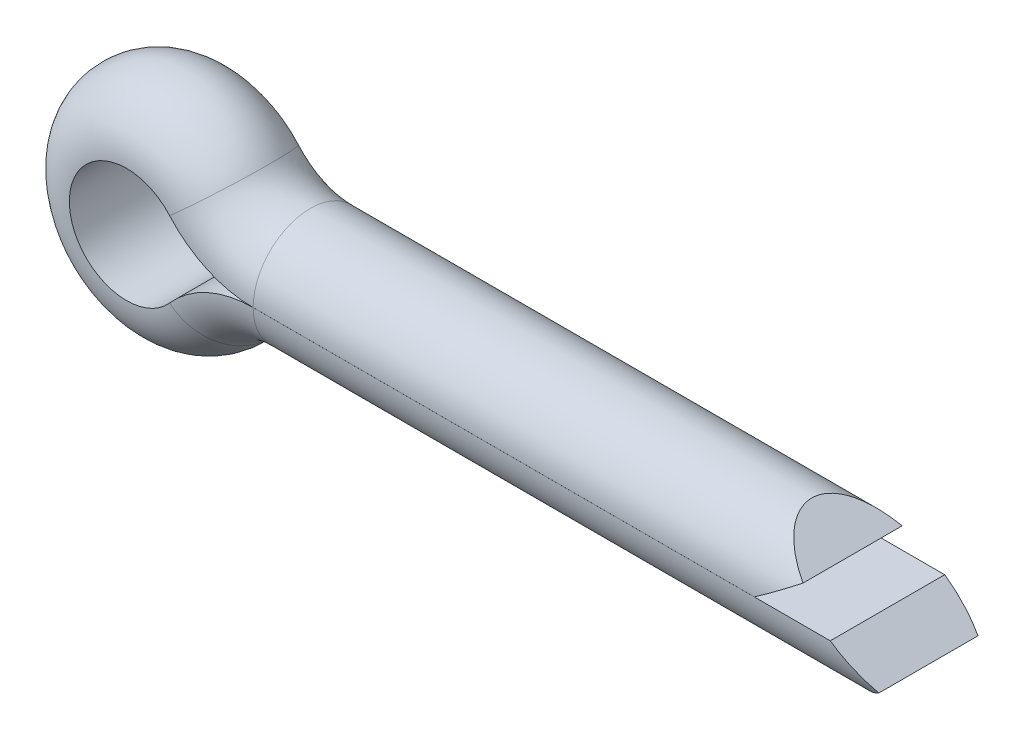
ISO-10303-21;
HEADER;
FILE_DESCRIPTION(('STEP AP214'),'2;1');
FILE_NAME('part.step','',(''),(''),'','','');
FILE_SCHEMA(('AUTOMOTIVE_DESIGN { 1 0 10303 214 1 1 1 1 }'));
ENDSEC;
DATA;
#1=APPLICATION_CONTEXT('core data for automotive mechanical design processes');
#2=APPLICATION_PROTOCOL_DEFINITION('international standard','automotive_design',2000,#1);
#3=PRODUCT_CONTEXT('',#1,'mechanical');
#4=PRODUCT('Part','Part','',(#3));
#5=PRODUCT_RELATED_PRODUCT_CATEGORY('part','',(#4));
#6=PRODUCT_DEFINITION_FORMATION('','',#4);
#7=PRODUCT_DEFINITION_CONTEXT('part definition',#1,'design');
#8=PRODUCT_DEFINITION('design','',#6,#7);
#9=PRODUCT_DEFINITION_SHAPE('','',#8);
#10=(LENGTH_UNIT() NAMED_UNIT(*) SI_UNIT(.MILLI.,.METRE.));
#11=(NAMED_UNIT(*) PLANE_ANGLE_UNIT() SI_UNIT($,.RADIAN.));
#12=(NAMED_UNIT(*) SI_UNIT($,.STERADIAN.) SOLID_ANGLE_UNIT());
#13=UNCERTAINTY_MEASURE_WITH_UNIT(LENGTH_MEASURE(1.E-05),#10,'distance_accuracy_value','');
#14=(GEOMETRIC_REPRESENTATION_CONTEXT(3) GLOBAL_UNCERTAINTY_ASSIGNED_CONTEXT((#13)) GLOBAL_UNIT_ASSIGNED_CONTEXT((#10,
#11,#12)) REPRESENTATION_CONTEXT('',''));
#15=CARTESIAN_POINT('',(0.,0.,0.));
#16=DIRECTION('',(0.,0.,1.));
#17=DIRECTION('',(1.,0.,0.));
#18=AXIS2_PLACEMENT_3D('',#15,#16,#17);
#19=CARTESIAN_POINT('',(0.,-0.00199999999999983,4.74999957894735));
#20=DIRECTION('',(0.,-1.,0.));
#21=DIRECTION('',(0.,0.,-1.));
#22=AXIS2_PLACEMENT_3D('',#19,#20,#21);
#23=PLANE('',#22);
#24=DIRECTION('',(1.,0.,0.));
#25=VECTOR('',#24,1.);
#26=CARTESIAN_POINT('',(0.,-0.00199999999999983,4.74999957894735));
#27=LINE('',#26,#25);
#28=CARTESIAN_POINT('',(0.,-0.00199999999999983,4.74999957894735));
#29=VERTEX_POINT('',#28);
#30=CARTESIAN_POINT('',(47.9010703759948,-0.00199999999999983,4.74999957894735));
#31=VERTEX_POINT('',#30);
#32=EDGE_CURVE('E40',#29,#31,#27,.T.);
#33=ORIENTED_EDGE('',*,*,#32,.T.);
#34=DIRECTION('',(0.,0.,-1.));
#35=VECTOR('',#34,1.);
#36=CARTESIAN_POINT('',(47.9010703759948,-0.00199999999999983,4.74999957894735));
#37=LINE('',#36,#35);
#38=CARTESIAN_POINT('',(47.9010703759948,-0.00199999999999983,-4.74999957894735));
#39=VERTEX_POINT('',#38);
#40=EDGE_CURVE('E96',#31,#39,#37,.T.);
#41=ORIENTED_EDGE('',*,*,#40,.T.);
#42=DIRECTION('',(1.,0.,0.));
#43=VECTOR('',#42,1.);
#44=CARTESIAN_POINT('',(0.,-0.00199999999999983,-4.74999957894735));
#45=LINE('',#44,#43);
#46=CARTESIAN_POINT('',(0.,-0.00199999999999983,-4.74999957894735));
#47=VERTEX_POINT('',#46);
#48=EDGE_CURVE('E11',#47,#39,#45,.T.);
#49=ORIENTED_EDGE('',*,*,#48,.F.);
#50=DIRECTION('',(0.,0.,-1.));
#51=VECTOR('',#50,1.);
#52=CARTESIAN_POINT('',(0.,-0.00199999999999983,4.74999957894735));
#53=LINE('',#52,#51);
#54=EDGE_CURVE('E113',#29,#47,#53,.T.);
#55=ORIENTED_EDGE('',*,*,#54,.F.);
#56=EDGE_LOOP('',(#33,#41,#49,#55));
#57=FACE_BOUND('',#56,.T.);
#58=ADVANCED_FACE('F33',(#57),#23,.F.);
#59=CARTESIAN_POINT('',(0.,0.,0.));
#60=DIRECTION('',(1.,0.,0.));
#61=DIRECTION('',(0.,0.,-1.));
#62=AXIS2_PLACEMENT_3D('',#59,#60,#61);
#63=CYLINDRICAL_SURFACE('',#62,4.75);
#64=CARTESIAN_POINT('',(54.6847948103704,0.,0.));
#65=DIRECTION('',(-0.574540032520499,0.818476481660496,0.));
#66=DIRECTION('',(0.818476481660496,0.574540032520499,0.));
#67=AXIS2_PLACEMENT_3D('',#64,#65,#66);
#68=ELLIPSE('',#67,8.26748308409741,4.75);
#69=CARTESIAN_POINT('',(51.3000000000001,-2.37599999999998,-4.11304315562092));
#70=VERTEX_POINT('',#69);
#71=CARTESIAN_POINT('',(51.3000000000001,-2.376,4.11304315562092));
#72=VERTEX_POINT('',#71);
#73=EDGE_CURVE('E110',#70,#72,#68,.T.);
#74=ORIENTED_EDGE('',*,*,#73,.T.);
#75=CARTESIAN_POINT('',(47.8982069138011,0.,0.));
#76=DIRECTION('',(-0.572612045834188,-0.819826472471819,0.));
#77=DIRECTION('',(0.819826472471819,-0.572612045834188,0.));
#78=AXIS2_PLACEMENT_3D('',#75,#76,#77);
#79=ELLIPSE('',#78,8.29531972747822,4.75);
#80=EDGE_CURVE('E99',#72,#31,#79,.T.);
#81=ORIENTED_EDGE('',*,*,#80,.T.);
#82=ORIENTED_EDGE('',*,*,#32,.F.);
#83=CARTESIAN_POINT('',(0.,0.,0.));
#84=DIRECTION('',(-1.,0.,0.));
#85=DIRECTION('',(0.,0.,-1.));
#86=AXIS2_PLACEMENT_3D('',#83,#84,#85);
#87=CIRCLE('',#86,4.75);
#88=EDGE_CURVE('E123',#47,#29,#87,.T.);
#89=ORIENTED_EDGE('',*,*,#88,.F.);
#90=ORIENTED_EDGE('',*,*,#48,.T.);
#91=EDGE_CURVE('E101',#39,#70,#79,.T.);
#92=ORIENTED_EDGE('',*,*,#91,.T.);
#93=EDGE_LOOP('',(#74,#81,#82,#89,#90,#92));
#94=FACE_BOUND('',#93,.T.);
#95=ADVANCED_FACE('F107',(#94),#63,.T.);
#96=CARTESIAN_POINT('',(0.,-9.23026315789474,0.));
#97=DIRECTION('',(0.,0.,-1.));
#98=DIRECTION('',(-1.,0.,0.));
#99=AXIS2_PLACEMENT_3D('',#96,#97,#98);
#100=CYLINDRICAL_SURFACE('',#99,9.22826315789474);
#101=DIRECTION('',(0.,0.,-1.));
#102=VECTOR('',#101,1.);
#103=CARTESIAN_POINT('',(-6.93096847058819,-3.13743811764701,4.74999957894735));
#104=LINE('',#103,#102);
#105=CARTESIAN_POINT('',(-6.93096847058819,-3.13743811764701,4.74999957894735));
#106=VERTEX_POINT('',#105);
#107=CARTESIAN_POINT('',(-6.93096847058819,-3.13743811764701,-4.74999957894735));
#108=VERTEX_POINT('',#107);
#109=EDGE_CURVE('E131',#106,#108,#104,.T.);
#110=ORIENTED_EDGE('',*,*,#109,.F.);
#111=CARTESIAN_POINT('',(0.,-9.23026315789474,4.74999957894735));
#112=DIRECTION('',(0.,0.,-1.));
#113=DIRECTION('',(-1.,0.,0.));
#114=AXIS2_PLACEMENT_3D('',#111,#112,#113);
#115=CIRCLE('',#114,9.22826315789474);
#116=EDGE_CURVE('E117',#106,#29,#115,.T.);
#117=ORIENTED_EDGE('',*,*,#116,.T.);
#118=ORIENTED_EDGE('',*,*,#54,.T.);
#119=CARTESIAN_POINT('',(0.,-9.23026315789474,-4.74999957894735));
#120=DIRECTION('',(0.,0.,-1.));
#121=DIRECTION('',(-1.,0.,0.));
#122=AXIS2_PLACEMENT_3D('',#119,#120,#121);
#123=CIRCLE('',#122,9.22826315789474);
#124=EDGE_CURVE('E115',#108,#47,#123,.T.);
#125=ORIENTED_EDGE('',*,*,#124,.F.);
#126=EDGE_LOOP('',(#110,#117,#118,#125));
#127=FACE_BOUND('',#126,.T.);
#128=ADVANCED_FACE('F196',(#127),#100,.T.);
#129=CARTESIAN_POINT('',(0.,-9.23026315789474,0.));
#130=DIRECTION('',(0.,0.,-1.));
#131=DIRECTION('',(-1.,0.,0.));
#132=AXIS2_PLACEMENT_3D('',#129,#130,#131);
#133=TOROIDAL_SURFACE('',#132,9.23026315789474,4.75);
#134=CARTESIAN_POINT('',(-6.93247058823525,-3.13611764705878,0.));
#135=DIRECTION('',(-0.660235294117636,-0.751058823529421,0.));
#136=DIRECTION('',(0.,0.,-1.));
#137=AXIS2_PLACEMENT_3D('',#134,#135,#136);
#138=CIRCLE('',#137,4.75);
#139=EDGE_CURVE('E134',#108,#106,#138,.T.);
#140=ORIENTED_EDGE('',*,*,#139,.F.);
#141=ORIENTED_EDGE('',*,*,#124,.T.);
#142=ORIENTED_EDGE('',*,*,#88,.T.);
#143=ORIENTED_EDGE('',*,*,#116,.F.);
#144=EDGE_LOOP('',(#140,#141,#142,#143));
#145=FACE_BOUND('',#144,.T.);
#146=ADVANCED_FACE('F198',(#145),#133,.T.);
#147=CARTESIAN_POINT('',(-10.5,0.,0.));
#148=DIRECTION('',(0.,0.,1.));
#149=DIRECTION('',(1.,0.,0.));
#150=AXIS2_PLACEMENT_3D('',#147,#148,#149);
#151=CYLINDRICAL_SURFACE('',#150,4.752);
#152=DIRECTION('',(0.,0.,-1.));
#153=VECTOR('',#152,1.);
#154=CARTESIAN_POINT('',(-6.93096847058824,3.13743811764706,4.74999957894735));
#155=LINE('',#154,#153);
#156=CARTESIAN_POINT('',(-6.93096847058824,3.13743811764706,4.74999957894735));
#157=VERTEX_POINT('',#156);
#158=CARTESIAN_POINT('',(-6.93096847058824,3.13743811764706,-4.74999957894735));
#159=VERTEX_POINT('',#158);
#160=EDGE_CURVE('E143',#157,#159,#155,.T.);
#161=ORIENTED_EDGE('',*,*,#160,.F.);
#162=CARTESIAN_POINT('',(-10.5,0.,4.74999957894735));
#163=DIRECTION('',(0.,0.,1.));
#164=DIRECTION('',(1.,0.,0.));
#165=AXIS2_PLACEMENT_3D('',#162,#163,#164);
#166=CIRCLE('',#165,4.752);
#167=EDGE_CURVE('E128',#157,#106,#166,.T.);
#168=ORIENTED_EDGE('',*,*,#167,.T.);
#169=ORIENTED_EDGE('',*,*,#109,.T.);
#170=CARTESIAN_POINT('',(-10.5,0.,-4.74999957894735));
#171=DIRECTION('',(0.,0.,1.));
#172=DIRECTION('',(1.,0.,0.));
#173=AXIS2_PLACEMENT_3D('',#170,#171,#172);
#174=CIRCLE('',#173,4.752);
#175=EDGE_CURVE('E125',#159,#108,#174,.T.);
#176=ORIENTED_EDGE('',*,*,#175,.F.);
#177=EDGE_LOOP('',(#161,#168,#169,#176));
#178=FACE_BOUND('',#177,.T.);
#179=ADVANCED_FACE('F193',(#178),#151,.F.);
#180=CARTESIAN_POINT('',(-10.5,0.,0.));
#181=DIRECTION('',(0.,0.,1.));
#182=DIRECTION('',(1.,0.,0.));
#183=AXIS2_PLACEMENT_3D('',#180,#181,#182);
#184=DEGENERATE_TOROIDAL_SURFACE('',#183,4.75,4.75,.T.);
#185=CARTESIAN_POINT('',(-6.93247058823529,3.13611764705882,0.));
#186=DIRECTION('',(0.660235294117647,-0.751058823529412,0.));
#187=DIRECTION('',(0.,0.,-1.));
#188=AXIS2_PLACEMENT_3D('',#185,#186,#187);
#189=CIRCLE('',#188,4.75);
#190=EDGE_CURVE('E146',#159,#157,#189,.T.);
#191=ORIENTED_EDGE('',*,*,#190,.F.);
#192=ORIENTED_EDGE('',*,*,#175,.T.);
#193=ORIENTED_EDGE('',*,*,#139,.T.);
#194=ORIENTED_EDGE('',*,*,#167,.F.);
#195=EDGE_LOOP('',(#191,#192,#193,#194));
#196=FACE_BOUND('',#195,.T.);
#197=ADVANCED_FACE('F190',(#196),#184,.T.);
#198=CARTESIAN_POINT('',(0.,9.23026315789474,0.));
#199=DIRECTION('',(0.,0.,-1.));
#200=DIRECTION('',(-1.,0.,0.));
#201=AXIS2_PLACEMENT_3D('',#198,#199,#200);
#202=CYLINDRICAL_SURFACE('',#201,9.22826315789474);
#203=DIRECTION('',(0.,0.,-1.));
#204=VECTOR('',#203,1.);
#205=CARTESIAN_POINT('',(0.,0.002,4.74999957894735));
#206=LINE('',#205,#204);
#207=CARTESIAN_POINT('',(0.,0.002,4.74999957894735));
#208=VERTEX_POINT('',#207);
#209=CARTESIAN_POINT('',(0.,0.002,-4.74999957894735));
#210=VERTEX_POINT('',#209);
#211=EDGE_CURVE('E153',#208,#210,#206,.T.);
#212=ORIENTED_EDGE('',*,*,#211,.F.);
#213=CARTESIAN_POINT('',(0.,9.23026315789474,4.74999957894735));
#214=DIRECTION('',(0.,0.,-1.));
#215=DIRECTION('',(-1.,0.,0.));
#216=AXIS2_PLACEMENT_3D('',#213,#214,#215);
#217=CIRCLE('',#216,9.22826315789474);
#218=EDGE_CURVE('E140',#208,#157,#217,.T.);
#219=ORIENTED_EDGE('',*,*,#218,.T.);
#220=ORIENTED_EDGE('',*,*,#160,.T.);
#221=CARTESIAN_POINT('',(0.,9.23026315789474,-4.74999957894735));
#222=DIRECTION('',(0.,0.,-1.));
#223=DIRECTION('',(-1.,0.,0.));
#224=AXIS2_PLACEMENT_3D('',#221,#222,#223);
#225=CIRCLE('',#224,9.22826315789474);
#226=EDGE_CURVE('E137',#210,#159,#225,.T.);
#227=ORIENTED_EDGE('',*,*,#226,.F.);
#228=EDGE_LOOP('',(#212,#219,#220,#227));
#229=FACE_BOUND('',#228,.T.);
#230=ADVANCED_FACE('F184',(#229),#202,.T.);
#231=CARTESIAN_POINT('',(0.,9.23026315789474,0.));
#232=DIRECTION('',(0.,0.,-1.));
#233=DIRECTION('',(-1.,0.,0.));
#234=AXIS2_PLACEMENT_3D('',#231,#232,#233);
#235=TOROIDAL_SURFACE('',#234,9.23026315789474,4.75);
#236=CARTESIAN_POINT('',(0.,0.,0.));
#237=DIRECTION('',(1.,0.,0.));
#238=DIRECTION('',(0.,0.,-1.));
#239=AXIS2_PLACEMENT_3D('',#236,#237,#238);
#240=CIRCLE('',#239,4.75);
#241=EDGE_CURVE('E158',#210,#208,#240,.T.);
#242=ORIENTED_EDGE('',*,*,#241,.F.);
#243=ORIENTED_EDGE('',*,*,#226,.T.);
#244=ORIENTED_EDGE('',*,*,#190,.T.);
#245=ORIENTED_EDGE('',*,*,#218,.F.);
#246=EDGE_LOOP('',(#242,#243,#244,#245));
#247=FACE_BOUND('',#246,.T.);
#248=ADVANCED_FACE('F187',(#247),#235,.T.);
#249=CARTESIAN_POINT('',(0.,0.,0.));
#250=DIRECTION('',(1.,0.,0.));
#251=DIRECTION('',(0.,0.,-1.));
#252=AXIS2_PLACEMENT_3D('',#249,#250,#251);
#253=CYLINDRICAL_SURFACE('',#252,4.75);
#254=CARTESIAN_POINT('',(41.598206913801,0.,0.));
#255=DIRECTION('',(-0.572612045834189,0.819826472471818,0.));
#256=DIRECTION('',(0.819826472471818,0.572612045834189,0.));
#257=AXIS2_PLACEMENT_3D('',#254,#255,#256);
#258=ELLIPSE('',#257,8.2953197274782,4.75);
#259=CARTESIAN_POINT('',(45.,2.376,4.11304315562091));
#260=VERTEX_POINT('',#259);
#261=CARTESIAN_POINT('',(41.6010703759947,0.002,4.74999957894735));
#262=VERTEX_POINT('',#261);
#263=EDGE_CURVE('E47',#260,#262,#258,.F.);
#264=ORIENTED_EDGE('',*,*,#263,.F.);
#265=CARTESIAN_POINT('',(48.3847948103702,0.,0.));
#266=DIRECTION('',(-0.574540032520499,-0.818476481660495,0.));
#267=DIRECTION('',(0.818476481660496,-0.574540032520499,0.));
#268=AXIS2_PLACEMENT_3D('',#265,#266,#267);
#269=ELLIPSE('',#268,8.2674830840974,4.75);
#270=CARTESIAN_POINT('',(45.,2.376,-4.11304315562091));
#271=VERTEX_POINT('',#270);
#272=EDGE_CURVE('E166',#271,#260,#269,.F.);
#273=ORIENTED_EDGE('',*,*,#272,.F.);
#274=CARTESIAN_POINT('',(41.6010703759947,0.00200000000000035,-4.74999957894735));
#275=VERTEX_POINT('',#274);
#276=EDGE_CURVE('E162',#275,#271,#258,.F.);
#277=ORIENTED_EDGE('',*,*,#276,.F.);
#278=DIRECTION('',(1.,0.,0.));
#279=VECTOR('',#278,1.);
#280=CARTESIAN_POINT('',(0.,0.002,-4.74999957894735));
#281=LINE('',#280,#279);
#282=EDGE_CURVE('E149',#210,#275,#281,.T.);
#283=ORIENTED_EDGE('',*,*,#282,.F.);
#284=ORIENTED_EDGE('',*,*,#241,.T.);
#285=DIRECTION('',(1.,0.,0.));
#286=VECTOR('',#285,1.);
#287=CARTESIAN_POINT('',(0.,0.002,4.74999957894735));
#288=LINE('',#287,#286);
#289=EDGE_CURVE('E150',#208,#262,#288,.T.);
#290=ORIENTED_EDGE('',*,*,#289,.T.);
#291=EDGE_LOOP('',(#264,#273,#277,#283,#284,#290));
#292=FACE_BOUND('',#291,.T.);
#293=ADVANCED_FACE('F176',(#292),#253,.T.);
#294=CARTESIAN_POINT('',(0.,0.002,4.74999957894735));
#295=DIRECTION('',(0.,-1.,0.));
#296=DIRECTION('',(0.,0.,-1.));
#297=AXIS2_PLACEMENT_3D('',#294,#295,#296);
#298=PLANE('',#297);
#299=DIRECTION('',(0.,0.,-1.));
#300=VECTOR('',#299,1.);
#301=CARTESIAN_POINT('',(41.6010703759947,0.002,4.74999957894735));
#302=LINE('',#301,#300);
#303=EDGE_CURVE('E164',#262,#275,#302,.T.);
#304=ORIENTED_EDGE('',*,*,#303,.F.);
#305=ORIENTED_EDGE('',*,*,#289,.F.);
#306=ORIENTED_EDGE('',*,*,#211,.T.);
#307=ORIENTED_EDGE('',*,*,#282,.T.);
#308=EDGE_LOOP('',(#304,#305,#306,#307));
#309=FACE_BOUND('',#308,.T.);
#310=ADVANCED_FACE('F181',(#309),#298,.T.);
#311=CARTESIAN_POINT('',(45.,2.376,-4.74999957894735));
#312=DIRECTION('',(-0.572612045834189,0.819826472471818,0.));
#313=DIRECTION('',(-0.819826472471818,-0.572612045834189,0.));
#314=AXIS2_PLACEMENT_3D('',#311,#312,#313);
#315=PLANE('',#314);
#316=ORIENTED_EDGE('',*,*,#263,.T.);
#317=ORIENTED_EDGE('',*,*,#303,.T.);
#318=ORIENTED_EDGE('',*,*,#276,.T.);
#319=DIRECTION('',(0.,0.,1.));
#320=VECTOR('',#319,1.);
#321=CARTESIAN_POINT('',(45.,2.376,-4.74999957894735));
#322=LINE('',#321,#320);
#323=EDGE_CURVE('E168',#271,#260,#322,.T.);
#324=ORIENTED_EDGE('',*,*,#323,.T.);
#325=EDGE_LOOP('',(#316,#317,#318,#324));
#326=FACE_BOUND('',#325,.T.);
#327=ADVANCED_FACE('F171',(#326),#315,.F.);
#328=CARTESIAN_POINT('',(45.,2.376,-4.74999957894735));
#329=DIRECTION('',(-0.574540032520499,-0.818476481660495,0.));
#330=DIRECTION('',(0.818476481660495,-0.574540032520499,0.));
#331=AXIS2_PLACEMENT_3D('',#328,#329,#330);
#332=PLANE('',#331);
#333=ORIENTED_EDGE('',*,*,#272,.T.);
#334=ORIENTED_EDGE('',*,*,#323,.F.);
#335=EDGE_LOOP('',(#333,#334));
#336=FACE_BOUND('',#335,.T.);
#337=ADVANCED_FACE('F277',(#336),#332,.F.);
#338=CARTESIAN_POINT('',(51.3000000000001,-2.376,-4.74999957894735));
#339=DIRECTION('',(-0.574540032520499,0.818476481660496,0.));
#340=DIRECTION('',(-0.818476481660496,-0.574540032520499,0.));
#341=AXIS2_PLACEMENT_3D('',#338,#339,#340);
#342=PLANE('',#341);
#343=DIRECTION('',(0.,0.,1.));
#344=VECTOR('',#343,1.);
#345=CARTESIAN_POINT('',(51.3000000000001,-2.376,-4.74999957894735));
#346=LINE('',#345,#344);
#347=EDGE_CURVE('E55',#70,#72,#346,.T.);
#348=ORIENTED_EDGE('',*,*,#347,.T.);
#349=ORIENTED_EDGE('',*,*,#73,.F.);
#350=EDGE_LOOP('',(#348,#349));
#351=FACE_BOUND('',#350,.T.);
#352=ADVANCED_FACE('F284',(#351),#342,.F.);
#353=CARTESIAN_POINT('',(51.3000000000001,-2.376,-4.74999957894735));
#354=DIRECTION('',(-0.572612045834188,-0.819826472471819,0.));
#355=DIRECTION('',(0.819826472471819,-0.572612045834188,0.));
#356=AXIS2_PLACEMENT_3D('',#353,#354,#355);
#357=PLANE('',#356);
#358=ORIENTED_EDGE('',*,*,#347,.F.);
#359=ORIENTED_EDGE('',*,*,#91,.F.);
#360=ORIENTED_EDGE('',*,*,#40,.F.);
#361=ORIENTED_EDGE('',*,*,#80,.F.);
#362=EDGE_LOOP('',(#358,#359,#360,#361));
#363=FACE_BOUND('',#362,.T.);
#364=ADVANCED_FACE('F98',(#363),#357,.F.);
#365=CLOSED_SHELL('',(#58,#95,#128,#146,#179,#197,#230,#248,#293,#310,#327,#337,#352,#364));
#366=MANIFOLD_SOLID_BREP('B2',#365);
#367=ADVANCED_BREP_SHAPE_REPRESENTATION('',(#18,#366),#14);
#368=SHAPE_DEFINITION_REPRESENTATION(#9,#367);
ENDSEC;
END-ISO-10303-21;
